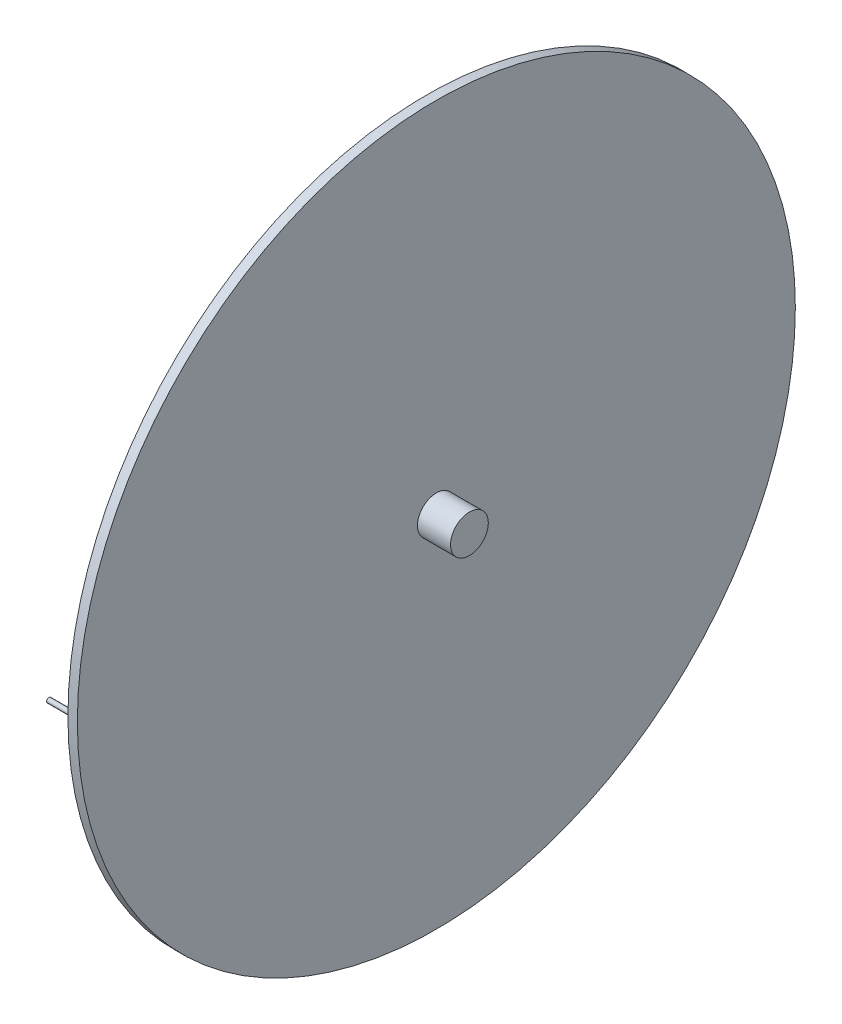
from build123d import *

# Parameters (mm, degrees)
SKETCH1_R           = 380
BOSS_EXTRUDE2_DEPTH = 10
SKETCH2_R           = 20
BOSS_EXTRUDE3_DEPTH = 35
SKETCH3_R           = 2.5
BOSS_EXTRUDE4_DEPTH = 25


with BuildPart() as part:
    # Sketch1 → Boss-Extrude2 (new body)
    with BuildSketch(Plane(origin=(0, 0, 0), x_dir=(0, 0, -1), z_dir=(1, 0, 0))):
        Circle(SKETCH1_R)
    extrude(amount=BOSS_EXTRUDE2_DEPTH)

    # Sketch2 → Boss-Extrude3 (add)
    with BuildSketch(Plane(origin=(10, 0, 0), x_dir=(0, 0, -1), z_dir=(1, 0, 0))):
        Circle(SKETCH2_R)
    extrude(amount=BOSS_EXTRUDE3_DEPTH)

    # Sketch3 → Boss-Extrude4 (add)
    with BuildSketch(Plane.ZY):
        with Locations(Location((375, 0, 0), (0, 0, 180))):
            Circle(SKETCH3_R)
    extrude(amount=BOSS_EXTRUDE4_DEPTH)


solid = part.part
